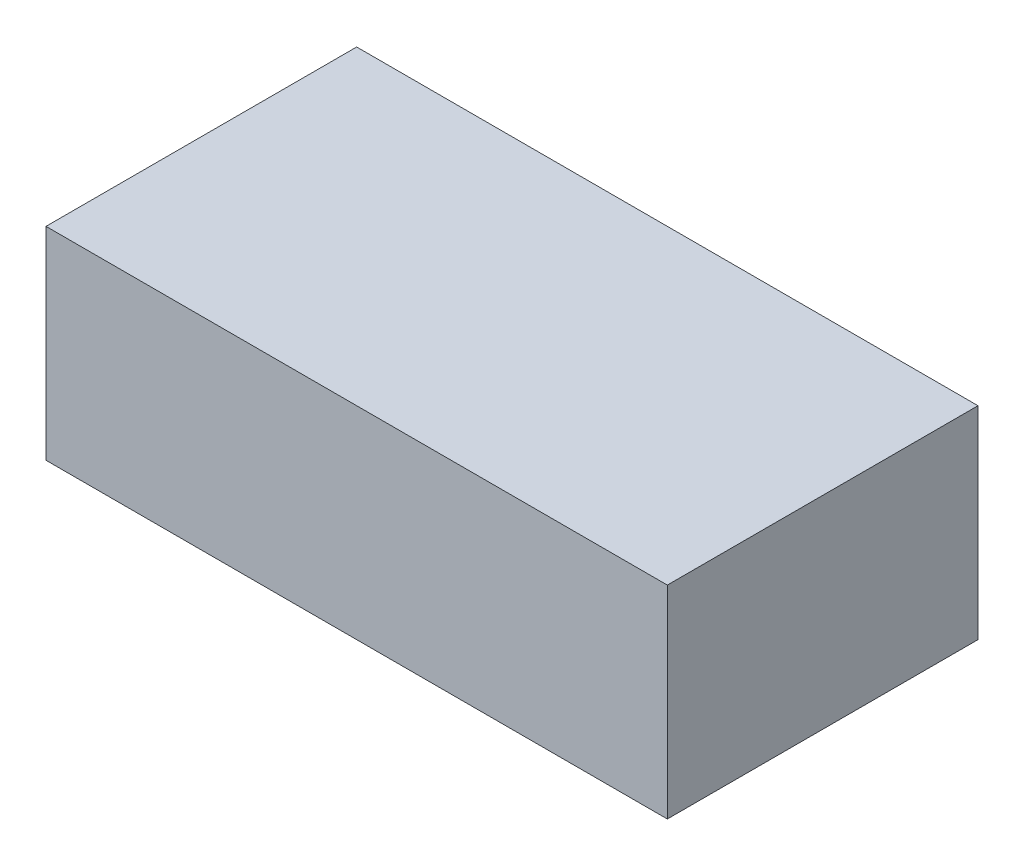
ISO-10303-21;
HEADER;
FILE_DESCRIPTION(('STEP AP214'),'2;1');
FILE_NAME('part.step','',(''),(''),'','','');
FILE_SCHEMA(('AUTOMOTIVE_DESIGN { 1 0 10303 214 1 1 1 1 }'));
ENDSEC;
DATA;
#1=APPLICATION_CONTEXT('core data for automotive mechanical design processes');
#2=APPLICATION_PROTOCOL_DEFINITION('international standard','automotive_design',2000,#1);
#3=PRODUCT_CONTEXT('',#1,'mechanical');
#4=PRODUCT('Part','Part','',(#3));
#5=PRODUCT_RELATED_PRODUCT_CATEGORY('part','',(#4));
#6=PRODUCT_DEFINITION_FORMATION('','',#4);
#7=PRODUCT_DEFINITION_CONTEXT('part definition',#1,'design');
#8=PRODUCT_DEFINITION('design','',#6,#7);
#9=PRODUCT_DEFINITION_SHAPE('','',#8);
#10=(LENGTH_UNIT() NAMED_UNIT(*) SI_UNIT(.MILLI.,.METRE.));
#11=(NAMED_UNIT(*) PLANE_ANGLE_UNIT() SI_UNIT($,.RADIAN.));
#12=(NAMED_UNIT(*) SI_UNIT($,.STERADIAN.) SOLID_ANGLE_UNIT());
#13=UNCERTAINTY_MEASURE_WITH_UNIT(LENGTH_MEASURE(1.E-05),#10,'distance_accuracy_value','');
#14=(GEOMETRIC_REPRESENTATION_CONTEXT(3) GLOBAL_UNCERTAINTY_ASSIGNED_CONTEXT((#13)) GLOBAL_UNIT_ASSIGNED_CONTEXT((#10,
#11,#12)) REPRESENTATION_CONTEXT('',''));
#15=CARTESIAN_POINT('',(0.,0.,0.));
#16=DIRECTION('',(0.,0.,1.));
#17=DIRECTION('',(1.,0.,0.));
#18=AXIS2_PLACEMENT_3D('',#15,#16,#17);
#19=CARTESIAN_POINT('',(115.,37.5,-57.5));
#20=DIRECTION('',(-1.,0.,0.));
#21=DIRECTION('',(0.,0.,1.));
#22=AXIS2_PLACEMENT_3D('',#19,#20,#21);
#23=PLANE('',#22);
#24=DIRECTION('',(0.,0.,-1.));
#25=VECTOR('',#24,1.);
#26=CARTESIAN_POINT('',(115.,-37.5,-57.5));
#27=LINE('',#26,#25);
#28=CARTESIAN_POINT('',(115.,-37.5,57.5));
#29=VERTEX_POINT('',#28);
#30=CARTESIAN_POINT('',(115.,-37.5,-57.5));
#31=VERTEX_POINT('',#30);
#32=EDGE_CURVE('E100',#29,#31,#27,.T.);
#33=ORIENTED_EDGE('',*,*,#32,.T.);
#34=DIRECTION('',(0.,-1.,0.));
#35=VECTOR('',#34,1.);
#36=CARTESIAN_POINT('',(115.,37.5,-57.5));
#37=LINE('',#36,#35);
#38=CARTESIAN_POINT('',(115.,37.5,-57.5));
#39=VERTEX_POINT('',#38);
#40=EDGE_CURVE('E11',#39,#31,#37,.T.);
#41=ORIENTED_EDGE('',*,*,#40,.F.);
#42=DIRECTION('',(0.,0.,-1.));
#43=VECTOR('',#42,1.);
#44=CARTESIAN_POINT('',(115.,37.5,-57.5));
#45=LINE('',#44,#43);
#46=CARTESIAN_POINT('',(115.,37.5,57.5));
#47=VERTEX_POINT('',#46);
#48=EDGE_CURVE('E88',#47,#39,#45,.T.);
#49=ORIENTED_EDGE('',*,*,#48,.F.);
#50=DIRECTION('',(0.,-1.,0.));
#51=VECTOR('',#50,1.);
#52=CARTESIAN_POINT('',(115.,37.5,57.5));
#53=LINE('',#52,#51);
#54=EDGE_CURVE('E96',#47,#29,#53,.T.);
#55=ORIENTED_EDGE('',*,*,#54,.T.);
#56=EDGE_LOOP('',(#33,#41,#49,#55));
#57=FACE_BOUND('',#56,.T.);
#58=ADVANCED_FACE('F37',(#57),#23,.F.);
#59=CARTESIAN_POINT('',(-115.,37.5,-57.5));
#60=DIRECTION('',(0.,0.,1.));
#61=DIRECTION('',(1.,0.,0.));
#62=AXIS2_PLACEMENT_3D('',#59,#60,#61);
#63=PLANE('',#62);
#64=DIRECTION('',(-1.,0.,0.));
#65=VECTOR('',#64,1.);
#66=CARTESIAN_POINT('',(-115.,-37.5,-57.5));
#67=LINE('',#66,#65);
#68=CARTESIAN_POINT('',(-115.,-37.5,-57.5));
#69=VERTEX_POINT('',#68);
#70=EDGE_CURVE('E92',#31,#69,#67,.T.);
#71=ORIENTED_EDGE('',*,*,#70,.T.);
#72=DIRECTION('',(0.,-1.,0.));
#73=VECTOR('',#72,1.);
#74=CARTESIAN_POINT('',(-115.,37.5,-57.5));
#75=LINE('',#74,#73);
#76=CARTESIAN_POINT('',(-115.,37.5,-57.5));
#77=VERTEX_POINT('',#76);
#78=EDGE_CURVE('E45',#77,#69,#75,.T.);
#79=ORIENTED_EDGE('',*,*,#78,.F.);
#80=DIRECTION('',(-1.,0.,0.));
#81=VECTOR('',#80,1.);
#82=CARTESIAN_POINT('',(-115.,37.5,-57.5));
#83=LINE('',#82,#81);
#84=EDGE_CURVE('E83',#39,#77,#83,.T.);
#85=ORIENTED_EDGE('',*,*,#84,.F.);
#86=ORIENTED_EDGE('',*,*,#40,.T.);
#87=EDGE_LOOP('',(#71,#79,#85,#86));
#88=FACE_BOUND('',#87,.T.);
#89=ADVANCED_FACE('F91',(#88),#63,.F.);
#90=CARTESIAN_POINT('',(-115.,37.5,-57.5));
#91=DIRECTION('',(1.,0.,0.));
#92=DIRECTION('',(0.,0.,-1.));
#93=AXIS2_PLACEMENT_3D('',#90,#91,#92);
#94=PLANE('',#93);
#95=DIRECTION('',(0.,0.,1.));
#96=VECTOR('',#95,1.);
#97=CARTESIAN_POINT('',(-115.,-37.5,-57.5));
#98=LINE('',#97,#96);
#99=CARTESIAN_POINT('',(-115.,-37.5,57.5));
#100=VERTEX_POINT('',#99);
#101=EDGE_CURVE('E70',#69,#100,#98,.T.);
#102=ORIENTED_EDGE('',*,*,#101,.T.);
#103=DIRECTION('',(0.,-1.,0.));
#104=VECTOR('',#103,1.);
#105=CARTESIAN_POINT('',(-115.,37.5,57.5));
#106=LINE('',#105,#104);
#107=CARTESIAN_POINT('',(-115.,37.5,57.5));
#108=VERTEX_POINT('',#107);
#109=EDGE_CURVE('E93',#108,#100,#106,.T.);
#110=ORIENTED_EDGE('',*,*,#109,.F.);
#111=DIRECTION('',(0.,0.,1.));
#112=VECTOR('',#111,1.);
#113=CARTESIAN_POINT('',(-115.,37.5,-57.5));
#114=LINE('',#113,#112);
#115=EDGE_CURVE('E86',#77,#108,#114,.T.);
#116=ORIENTED_EDGE('',*,*,#115,.F.);
#117=ORIENTED_EDGE('',*,*,#78,.T.);
#118=EDGE_LOOP('',(#102,#110,#116,#117));
#119=FACE_BOUND('',#118,.T.);
#120=ADVANCED_FACE('F94',(#119),#94,.F.);
#121=CARTESIAN_POINT('',(-115.,37.5,57.5));
#122=DIRECTION('',(0.,0.,-1.));
#123=DIRECTION('',(-1.,0.,0.));
#124=AXIS2_PLACEMENT_3D('',#121,#122,#123);
#125=PLANE('',#124);
#126=DIRECTION('',(1.,0.,0.));
#127=VECTOR('',#126,1.);
#128=CARTESIAN_POINT('',(-115.,-37.5,57.5));
#129=LINE('',#128,#127);
#130=EDGE_CURVE('E76',#100,#29,#129,.T.);
#131=ORIENTED_EDGE('',*,*,#130,.T.);
#132=ORIENTED_EDGE('',*,*,#54,.F.);
#133=DIRECTION('',(1.,0.,0.));
#134=VECTOR('',#133,1.);
#135=CARTESIAN_POINT('',(-115.,37.5,57.5));
#136=LINE('',#135,#134);
#137=EDGE_CURVE('E53',#108,#47,#136,.T.);
#138=ORIENTED_EDGE('',*,*,#137,.F.);
#139=ORIENTED_EDGE('',*,*,#109,.T.);
#140=EDGE_LOOP('',(#131,#132,#138,#139));
#141=FACE_BOUND('',#140,.T.);
#142=ADVANCED_FACE('F107',(#141),#125,.F.);
#143=CARTESIAN_POINT('',(0.,37.5,0.));
#144=DIRECTION('',(0.,1.,0.));
#145=DIRECTION('',(0.,0.,1.));
#146=AXIS2_PLACEMENT_3D('',#143,#144,#145);
#147=PLANE('',#146);
#148=ORIENTED_EDGE('',*,*,#48,.T.);
#149=ORIENTED_EDGE('',*,*,#84,.T.);
#150=ORIENTED_EDGE('',*,*,#115,.T.);
#151=ORIENTED_EDGE('',*,*,#137,.T.);
#152=EDGE_LOOP('',(#148,#149,#150,#151));
#153=FACE_BOUND('',#152,.T.);
#154=ADVANCED_FACE('F84',(#153),#147,.T.);
#155=CARTESIAN_POINT('',(0.,-37.5,0.));
#156=DIRECTION('',(0.,1.,0.));
#157=DIRECTION('',(0.,0.,1.));
#158=AXIS2_PLACEMENT_3D('',#155,#156,#157);
#159=PLANE('',#158);
#160=ORIENTED_EDGE('',*,*,#32,.F.);
#161=ORIENTED_EDGE('',*,*,#130,.F.);
#162=ORIENTED_EDGE('',*,*,#101,.F.);
#163=ORIENTED_EDGE('',*,*,#70,.F.);
#164=EDGE_LOOP('',(#160,#161,#162,#163));
#165=FACE_BOUND('',#164,.T.);
#166=ADVANCED_FACE('F110',(#165),#159,.F.);
#167=CLOSED_SHELL('',(#58,#89,#120,#142,#154,#166));
#168=MANIFOLD_SOLID_BREP('B2',#167);
#169=ADVANCED_BREP_SHAPE_REPRESENTATION('',(#18,#168),#14);
#170=SHAPE_DEFINITION_REPRESENTATION(#9,#169);
ENDSEC;
END-ISO-10303-21;
